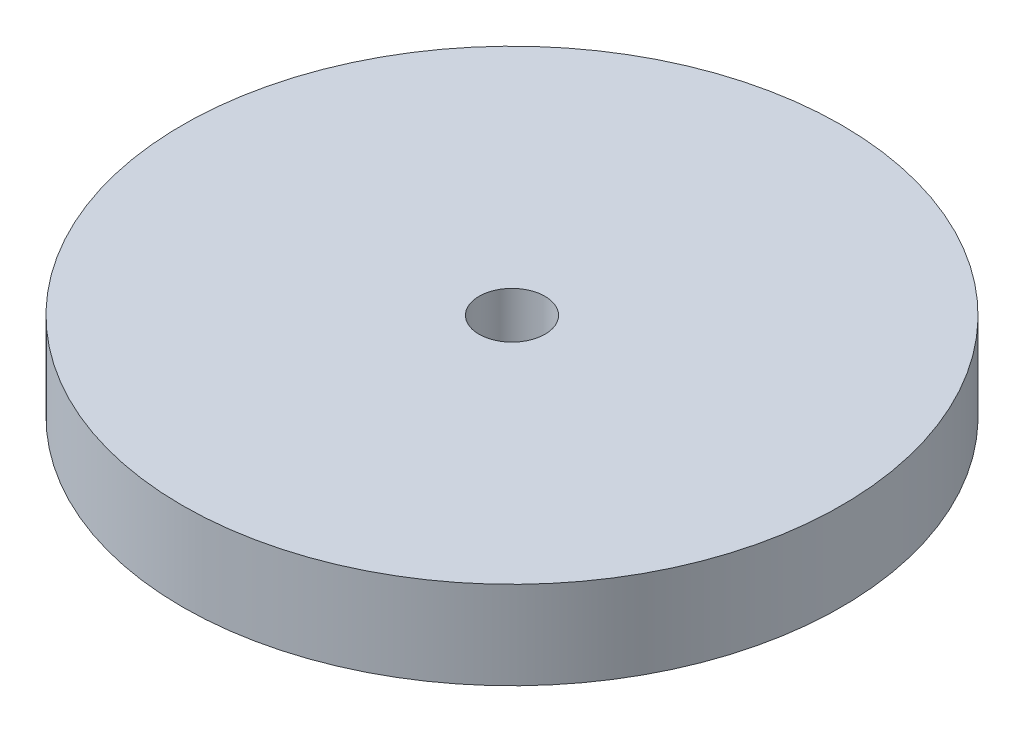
from build123d import *

# Parameters (mm, degrees)
SKETCH1_R          = 75
EXTRUDE1_DEPTH     = 20
SKETCH3_R          = 7.5
CUT_EXTRUDE1_DEPTH = 108.935165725


with BuildPart() as part:
    # Sketch1 → Extrude1 (new body)
    with BuildSketch(Plane(origin=(0, 0, 0), x_dir=(1, 0, 0), z_dir=(0, 1, 0))):
        with Locations(Location((0, 0, 0), (0, 0, 270))):
            Circle(SKETCH1_R)
    extrude(amount=EXTRUDE1_DEPTH)

    # Sketch3 → Cut-Extrude1 (cut, through all)
    with BuildSketch(Plane(origin=(0, 20, 0), x_dir=(-1, 0, 0), z_dir=(0, 1, 0))):
        with Locations(Location((0, 0, 0), (0, 0, 90))):
            Circle(SKETCH3_R)
    extrude(amount=-CUT_EXTRUDE1_DEPTH, mode=Mode.SUBTRACT)


solid = part.part
